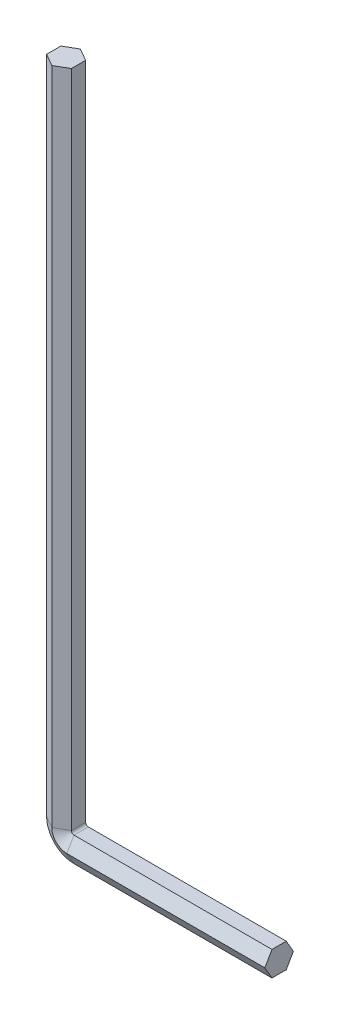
from build123d import *


with BuildPart() as part:
    # Sweep3: sweep along a path in Sketch1
    with BuildLine(Plane.XY) as sweep3_path:
        Line((0, 0), (-19.05, 0))
        ThreePointArc((-19.05, 0), (-20.071878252, 0.423275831), (-20.495154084, 1.445154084))
        Line((-20.495154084, 1.445154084), (-20.495154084, 64.945154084))
    # Sketch2 → Sweep3 (sweep)
    with BuildSketch(Plane(origin=(0, 0, 0), x_dir=(0, 0, -1), z_dir=(1, 0, 0))):
        Polygon((1.374815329, 0), (0.687407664, 1.190625), (-0.687407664, 1.190625), (-1.374815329, 0), (-0.687407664, -1.190625), (0.687407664, -1.190625), align=None)
    sweep(path=sweep3_path.line)


solid = part.part
